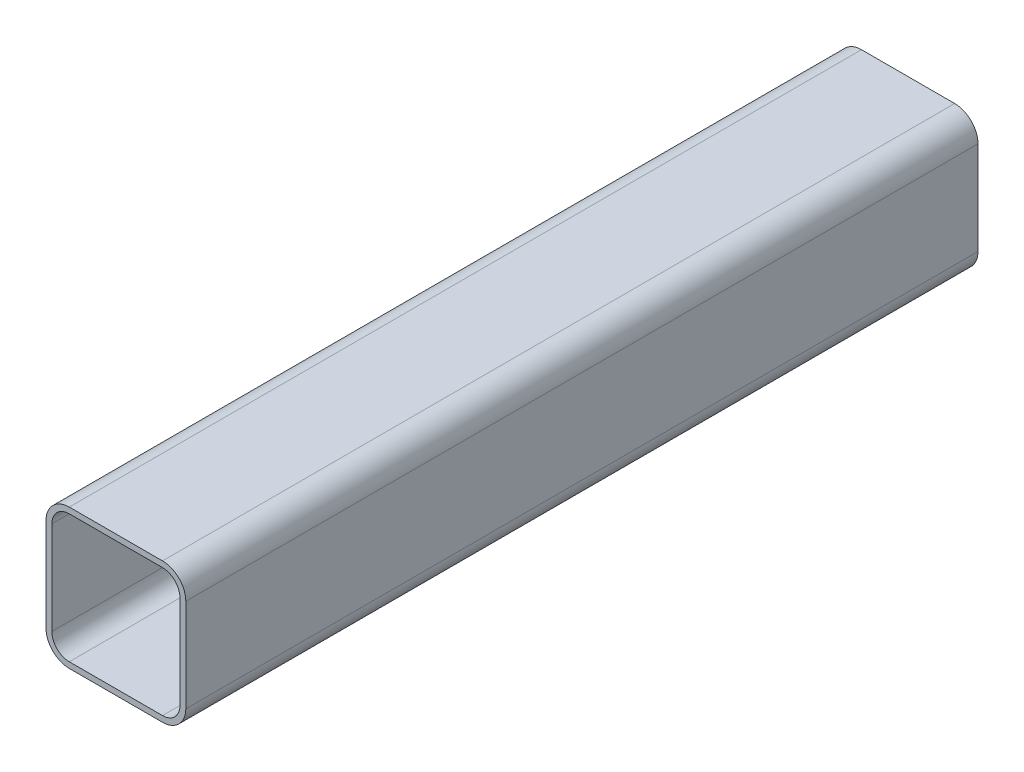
ISO-10303-21;
HEADER;
FILE_DESCRIPTION(('STEP AP214'),'2;1');
FILE_NAME('part.step','',(''),(''),'','','');
FILE_SCHEMA(('AUTOMOTIVE_DESIGN { 1 0 10303 214 1 1 1 1 }'));
ENDSEC;
DATA;
#1=APPLICATION_CONTEXT('core data for automotive mechanical design processes');
#2=APPLICATION_PROTOCOL_DEFINITION('international standard','automotive_design',2000,#1);
#3=PRODUCT_CONTEXT('',#1,'mechanical');
#4=PRODUCT('Part','Part','',(#3));
#5=PRODUCT_RELATED_PRODUCT_CATEGORY('part','',(#4));
#6=PRODUCT_DEFINITION_FORMATION('','',#4);
#7=PRODUCT_DEFINITION_CONTEXT('part definition',#1,'design');
#8=PRODUCT_DEFINITION('design','',#6,#7);
#9=PRODUCT_DEFINITION_SHAPE('','',#8);
#10=(LENGTH_UNIT() NAMED_UNIT(*) SI_UNIT(.MILLI.,.METRE.));
#11=(NAMED_UNIT(*) PLANE_ANGLE_UNIT() SI_UNIT($,.RADIAN.));
#12=(NAMED_UNIT(*) SI_UNIT($,.STERADIAN.) SOLID_ANGLE_UNIT());
#13=UNCERTAINTY_MEASURE_WITH_UNIT(LENGTH_MEASURE(1.E-05),#10,'distance_accuracy_value','');
#14=(GEOMETRIC_REPRESENTATION_CONTEXT(3) GLOBAL_UNCERTAINTY_ASSIGNED_CONTEXT((#13)) GLOBAL_UNIT_ASSIGNED_CONTEXT((#10,
#11,#12)) REPRESENTATION_CONTEXT('',''));
#15=CARTESIAN_POINT('',(0.,0.,0.));
#16=DIRECTION('',(0.,0.,1.));
#17=DIRECTION('',(1.,0.,0.));
#18=AXIS2_PLACEMENT_3D('',#15,#16,#17);
#19=CARTESIAN_POINT('',(25.4,25.4,431.8));
#20=DIRECTION('',(0.,0.,1.));
#21=DIRECTION('',(1.,0.,0.));
#22=AXIS2_PLACEMENT_3D('',#19,#20,#21);
#23=PLANE('',#22);
#24=CARTESIAN_POINT('',(25.4,25.4,431.8));
#25=DIRECTION('',(0.,0.,1.));
#26=DIRECTION('',(1.,0.,0.));
#27=AXIS2_PLACEMENT_3D('',#24,#25,#26);
#28=CIRCLE('',#27,12.7);
#29=CARTESIAN_POINT('',(38.1,25.4,431.8));
#30=VERTEX_POINT('',#29);
#31=CARTESIAN_POINT('',(25.4,38.1,431.8));
#32=VERTEX_POINT('',#31);
#33=EDGE_CURVE('E212',#30,#32,#28,.T.);
#34=ORIENTED_EDGE('',*,*,#33,.T.);
#35=DIRECTION('',(1.,0.,0.));
#36=VECTOR('',#35,1.);
#37=CARTESIAN_POINT('',(-25.4,38.1,431.8));
#38=LINE('',#37,#36);
#39=CARTESIAN_POINT('',(-25.4,38.1,431.8));
#40=VERTEX_POINT('',#39);
#41=EDGE_CURVE('E214',#40,#32,#38,.T.);
#42=ORIENTED_EDGE('',*,*,#41,.F.);
#43=CARTESIAN_POINT('',(-25.4,25.4,431.8));
#44=DIRECTION('',(0.,0.,-1.));
#45=DIRECTION('',(-1.,0.,0.));
#46=AXIS2_PLACEMENT_3D('',#43,#44,#45);
#47=CIRCLE('',#46,12.7);
#48=CARTESIAN_POINT('',(-38.1,25.4,431.8));
#49=VERTEX_POINT('',#48);
#50=EDGE_CURVE('E218',#49,#40,#47,.T.);
#51=ORIENTED_EDGE('',*,*,#50,.F.);
#52=DIRECTION('',(0.,-1.,0.));
#53=VECTOR('',#52,1.);
#54=CARTESIAN_POINT('',(-38.1,25.4,431.8));
#55=LINE('',#54,#53);
#56=CARTESIAN_POINT('',(-38.1,-25.4,431.8));
#57=VERTEX_POINT('',#56);
#58=EDGE_CURVE('E221',#49,#57,#55,.T.);
#59=ORIENTED_EDGE('',*,*,#58,.T.);
#60=CARTESIAN_POINT('',(-25.4,-25.4,431.8));
#61=DIRECTION('',(0.,0.,-1.));
#62=DIRECTION('',(-1.,0.,0.));
#63=AXIS2_PLACEMENT_3D('',#60,#61,#62);
#64=CIRCLE('',#63,12.7);
#65=CARTESIAN_POINT('',(-25.4,-38.1,431.8));
#66=VERTEX_POINT('',#65);
#67=EDGE_CURVE('E223',#66,#57,#64,.T.);
#68=ORIENTED_EDGE('',*,*,#67,.F.);
#69=DIRECTION('',(-1.,0.,0.));
#70=VECTOR('',#69,1.);
#71=CARTESIAN_POINT('',(25.4,-38.1,431.8));
#72=LINE('',#71,#70);
#73=CARTESIAN_POINT('',(25.4,-38.1,431.8));
#74=VERTEX_POINT('',#73);
#75=EDGE_CURVE('E226',#74,#66,#72,.T.);
#76=ORIENTED_EDGE('',*,*,#75,.F.);
#77=CARTESIAN_POINT('',(25.4,-25.4,431.8));
#78=DIRECTION('',(0.,0.,-1.));
#79=DIRECTION('',(-1.,0.,0.));
#80=AXIS2_PLACEMENT_3D('',#77,#78,#79);
#81=CIRCLE('',#80,12.7);
#82=CARTESIAN_POINT('',(38.1,-25.4000000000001,431.8));
#83=VERTEX_POINT('',#82);
#84=EDGE_CURVE('E229',#83,#74,#81,.T.);
#85=ORIENTED_EDGE('',*,*,#84,.F.);
#86=DIRECTION('',(0.,1.,0.));
#87=VECTOR('',#86,1.);
#88=CARTESIAN_POINT('',(38.1,-25.4000000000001,431.8));
#89=LINE('',#88,#87);
#90=EDGE_CURVE('E232',#83,#30,#89,.T.);
#91=ORIENTED_EDGE('',*,*,#90,.T.);
#92=EDGE_LOOP('',(#34,#42,#51,#59,#68,#76,#85,#91));
#93=FACE_BOUND('',#92,.T.);
#94=DIRECTION('',(1.,0.,0.));
#95=VECTOR('',#94,1.);
#96=CARTESIAN_POINT('',(-25.4,34.925,431.8));
#97=LINE('',#96,#95);
#98=CARTESIAN_POINT('',(-25.4,34.925,431.8));
#99=VERTEX_POINT('',#98);
#100=CARTESIAN_POINT('',(25.4,34.925,431.8));
#101=VERTEX_POINT('',#100);
#102=EDGE_CURVE('E152',#99,#101,#97,.T.);
#103=ORIENTED_EDGE('',*,*,#102,.T.);
#104=CARTESIAN_POINT('',(25.4,25.4,431.8));
#105=DIRECTION('',(0.,0.,1.));
#106=DIRECTION('',(1.,0.,0.));
#107=AXIS2_PLACEMENT_3D('',#104,#105,#106);
#108=CIRCLE('',#107,9.525);
#109=CARTESIAN_POINT('',(34.925,25.4,431.8));
#110=VERTEX_POINT('',#109);
#111=EDGE_CURVE('E143',#110,#101,#108,.T.);
#112=ORIENTED_EDGE('',*,*,#111,.F.);
#113=DIRECTION('',(0.,1.,0.));
#114=VECTOR('',#113,1.);
#115=CARTESIAN_POINT('',(34.925,-25.4000000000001,431.8));
#116=LINE('',#115,#114);
#117=CARTESIAN_POINT('',(34.925,-25.4000000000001,431.8));
#118=VERTEX_POINT('',#117);
#119=EDGE_CURVE('E179',#118,#110,#116,.T.);
#120=ORIENTED_EDGE('',*,*,#119,.F.);
#121=CARTESIAN_POINT('',(25.4,-25.4,431.8));
#122=DIRECTION('',(0.,0.,1.));
#123=DIRECTION('',(1.,0.,0.));
#124=AXIS2_PLACEMENT_3D('',#121,#122,#123);
#125=CIRCLE('',#124,9.525);
#126=CARTESIAN_POINT('',(25.4,-34.925,431.8));
#127=VERTEX_POINT('',#126);
#128=EDGE_CURVE('E47',#118,#127,#125,.F.);
#129=ORIENTED_EDGE('',*,*,#128,.T.);
#130=DIRECTION('',(-1.,0.,0.));
#131=VECTOR('',#130,1.);
#132=CARTESIAN_POINT('',(25.4,-34.925,431.8));
#133=LINE('',#132,#131);
#134=CARTESIAN_POINT('',(-25.4,-34.925,431.8));
#135=VERTEX_POINT('',#134);
#136=EDGE_CURVE('E175',#127,#135,#133,.T.);
#137=ORIENTED_EDGE('',*,*,#136,.T.);
#138=CARTESIAN_POINT('',(-25.4,-25.4,431.8));
#139=DIRECTION('',(0.,0.,1.));
#140=DIRECTION('',(1.,0.,0.));
#141=AXIS2_PLACEMENT_3D('',#138,#139,#140);
#142=CIRCLE('',#141,9.52499999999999);
#143=CARTESIAN_POINT('',(-34.925,-25.4,431.8));
#144=VERTEX_POINT('',#143);
#145=EDGE_CURVE('E172',#135,#144,#142,.F.);
#146=ORIENTED_EDGE('',*,*,#145,.T.);
#147=DIRECTION('',(0.,-1.,0.));
#148=VECTOR('',#147,1.);
#149=CARTESIAN_POINT('',(-34.925,25.4,431.8));
#150=LINE('',#149,#148);
#151=CARTESIAN_POINT('',(-34.925,25.4,431.8));
#152=VERTEX_POINT('',#151);
#153=EDGE_CURVE('E168',#152,#144,#150,.T.);
#154=ORIENTED_EDGE('',*,*,#153,.F.);
#155=CARTESIAN_POINT('',(-25.4,25.4,431.8));
#156=DIRECTION('',(0.,0.,1.));
#157=DIRECTION('',(1.,0.,0.));
#158=AXIS2_PLACEMENT_3D('',#155,#156,#157);
#159=CIRCLE('',#158,9.525);
#160=EDGE_CURVE('E166',#152,#99,#159,.F.);
#161=ORIENTED_EDGE('',*,*,#160,.T.);
#162=EDGE_LOOP('',(#103,#112,#120,#129,#137,#146,#154,#161));
#163=FACE_BOUND('',#162,.T.);
#164=ADVANCED_FACE('F32',(#93,#163),#23,.T.);
#165=CARTESIAN_POINT('',(25.4,25.4,0.));
#166=DIRECTION('',(0.,0.,1.));
#167=DIRECTION('',(1.,0.,0.));
#168=AXIS2_PLACEMENT_3D('',#165,#166,#167);
#169=PLANE('',#168);
#170=CARTESIAN_POINT('',(25.4,25.4,0.));
#171=DIRECTION('',(0.,0.,1.));
#172=DIRECTION('',(1.,0.,0.));
#173=AXIS2_PLACEMENT_3D('',#170,#171,#172);
#174=CIRCLE('',#173,12.7);
#175=CARTESIAN_POINT('',(38.1,25.4,0.));
#176=VERTEX_POINT('',#175);
#177=CARTESIAN_POINT('',(25.4,38.1,0.));
#178=VERTEX_POINT('',#177);
#179=EDGE_CURVE('E161',#176,#178,#174,.T.);
#180=ORIENTED_EDGE('',*,*,#179,.F.);
#181=DIRECTION('',(0.,1.,0.));
#182=VECTOR('',#181,1.);
#183=CARTESIAN_POINT('',(38.1,-25.4000000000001,0.));
#184=LINE('',#183,#182);
#185=CARTESIAN_POINT('',(38.1,-25.4000000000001,0.));
#186=VERTEX_POINT('',#185);
#187=EDGE_CURVE('E215',#186,#176,#184,.T.);
#188=ORIENTED_EDGE('',*,*,#187,.F.);
#189=CARTESIAN_POINT('',(25.4,-25.4,0.));
#190=DIRECTION('',(0.,0.,-1.));
#191=DIRECTION('',(-1.,0.,0.));
#192=AXIS2_PLACEMENT_3D('',#189,#190,#191);
#193=CIRCLE('',#192,12.7);
#194=CARTESIAN_POINT('',(25.4,-38.1,0.));
#195=VERTEX_POINT('',#194);
#196=EDGE_CURVE('E252',#186,#195,#193,.T.);
#197=ORIENTED_EDGE('',*,*,#196,.T.);
#198=DIRECTION('',(-1.,0.,0.));
#199=VECTOR('',#198,1.);
#200=CARTESIAN_POINT('',(25.4,-38.1,0.));
#201=LINE('',#200,#199);
#202=CARTESIAN_POINT('',(-25.4,-38.1,0.));
#203=VERTEX_POINT('',#202);
#204=EDGE_CURVE('E249',#195,#203,#201,.T.);
#205=ORIENTED_EDGE('',*,*,#204,.T.);
#206=CARTESIAN_POINT('',(-25.4,-25.4,0.));
#207=DIRECTION('',(0.,0.,-1.));
#208=DIRECTION('',(-1.,0.,0.));
#209=AXIS2_PLACEMENT_3D('',#206,#207,#208);
#210=CIRCLE('',#209,12.7);
#211=CARTESIAN_POINT('',(-38.1,-25.4,0.));
#212=VERTEX_POINT('',#211);
#213=EDGE_CURVE('E246',#203,#212,#210,.T.);
#214=ORIENTED_EDGE('',*,*,#213,.T.);
#215=DIRECTION('',(0.,-1.,0.));
#216=VECTOR('',#215,1.);
#217=CARTESIAN_POINT('',(-38.1,25.4,0.));
#218=LINE('',#217,#216);
#219=CARTESIAN_POINT('',(-38.1,25.4,0.));
#220=VERTEX_POINT('',#219);
#221=EDGE_CURVE('E243',#220,#212,#218,.T.);
#222=ORIENTED_EDGE('',*,*,#221,.F.);
#223=CARTESIAN_POINT('',(-25.4,25.4,0.));
#224=DIRECTION('',(0.,0.,-1.));
#225=DIRECTION('',(-1.,0.,0.));
#226=AXIS2_PLACEMENT_3D('',#223,#224,#225);
#227=CIRCLE('',#226,12.7);
#228=CARTESIAN_POINT('',(-25.4,38.1,0.));
#229=VERTEX_POINT('',#228);
#230=EDGE_CURVE('E240',#220,#229,#227,.T.);
#231=ORIENTED_EDGE('',*,*,#230,.T.);
#232=DIRECTION('',(1.,0.,0.));
#233=VECTOR('',#232,1.);
#234=CARTESIAN_POINT('',(-25.4,38.1,0.));
#235=LINE('',#234,#233);
#236=EDGE_CURVE('E237',#229,#178,#235,.T.);
#237=ORIENTED_EDGE('',*,*,#236,.T.);
#238=EDGE_LOOP('',(#180,#188,#197,#205,#214,#222,#231,#237));
#239=FACE_BOUND('',#238,.T.);
#240=CARTESIAN_POINT('',(25.4,25.4,0.));
#241=DIRECTION('',(0.,0.,1.));
#242=DIRECTION('',(1.,0.,0.));
#243=AXIS2_PLACEMENT_3D('',#240,#241,#242);
#244=CIRCLE('',#243,9.525);
#245=CARTESIAN_POINT('',(34.925,25.4,0.));
#246=VERTEX_POINT('',#245);
#247=CARTESIAN_POINT('',(25.4,34.925,0.));
#248=VERTEX_POINT('',#247);
#249=EDGE_CURVE('E55',#246,#248,#244,.T.);
#250=ORIENTED_EDGE('',*,*,#249,.T.);
#251=DIRECTION('',(1.,0.,0.));
#252=VECTOR('',#251,1.);
#253=CARTESIAN_POINT('',(-25.4,34.925,0.));
#254=LINE('',#253,#252);
#255=CARTESIAN_POINT('',(-25.4,34.925,0.));
#256=VERTEX_POINT('',#255);
#257=EDGE_CURVE('E160',#256,#248,#254,.T.);
#258=ORIENTED_EDGE('',*,*,#257,.F.);
#259=CARTESIAN_POINT('',(-25.4,25.4,0.));
#260=DIRECTION('',(0.,0.,1.));
#261=DIRECTION('',(1.,0.,0.));
#262=AXIS2_PLACEMENT_3D('',#259,#260,#261);
#263=CIRCLE('',#262,9.525);
#264=CARTESIAN_POINT('',(-34.925,25.4,0.));
#265=VERTEX_POINT('',#264);
#266=EDGE_CURVE('E183',#265,#256,#263,.F.);
#267=ORIENTED_EDGE('',*,*,#266,.F.);
#268=DIRECTION('',(0.,-1.,0.));
#269=VECTOR('',#268,1.);
#270=CARTESIAN_POINT('',(-34.925,25.4,0.));
#271=LINE('',#270,#269);
#272=CARTESIAN_POINT('',(-34.925,-25.4,0.));
#273=VERTEX_POINT('',#272);
#274=EDGE_CURVE('E186',#265,#273,#271,.T.);
#275=ORIENTED_EDGE('',*,*,#274,.T.);
#276=CARTESIAN_POINT('',(-25.4,-25.4,0.));
#277=DIRECTION('',(0.,0.,1.));
#278=DIRECTION('',(1.,0.,0.));
#279=AXIS2_PLACEMENT_3D('',#276,#277,#278);
#280=CIRCLE('',#279,9.52499999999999);
#281=CARTESIAN_POINT('',(-25.4,-34.925,0.));
#282=VERTEX_POINT('',#281);
#283=EDGE_CURVE('E189',#282,#273,#280,.F.);
#284=ORIENTED_EDGE('',*,*,#283,.F.);
#285=DIRECTION('',(-1.,0.,0.));
#286=VECTOR('',#285,1.);
#287=CARTESIAN_POINT('',(25.4,-34.925,0.));
#288=LINE('',#287,#286);
#289=CARTESIAN_POINT('',(25.4,-34.925,0.));
#290=VERTEX_POINT('',#289);
#291=EDGE_CURVE('E192',#290,#282,#288,.T.);
#292=ORIENTED_EDGE('',*,*,#291,.F.);
#293=CARTESIAN_POINT('',(25.4,-25.4,0.));
#294=DIRECTION('',(0.,0.,1.));
#295=DIRECTION('',(1.,0.,0.));
#296=AXIS2_PLACEMENT_3D('',#293,#294,#295);
#297=CIRCLE('',#296,9.525);
#298=CARTESIAN_POINT('',(34.925,-25.4000000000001,0.));
#299=VERTEX_POINT('',#298);
#300=EDGE_CURVE('E195',#299,#290,#297,.F.);
#301=ORIENTED_EDGE('',*,*,#300,.F.);
#302=DIRECTION('',(0.,1.,0.));
#303=VECTOR('',#302,1.);
#304=CARTESIAN_POINT('',(34.925,-25.4000000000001,0.));
#305=LINE('',#304,#303);
#306=EDGE_CURVE('E153',#299,#246,#305,.T.);
#307=ORIENTED_EDGE('',*,*,#306,.T.);
#308=EDGE_LOOP('',(#250,#258,#267,#275,#284,#292,#301,#307));
#309=FACE_BOUND('',#308,.T.);
#310=ADVANCED_FACE('F279',(#239,#309),#169,.F.);
#311=CARTESIAN_POINT('',(25.4,25.4,431.8));
#312=DIRECTION('',(0.,0.,-1.));
#313=DIRECTION('',(-1.,0.,0.));
#314=AXIS2_PLACEMENT_3D('',#311,#312,#313);
#315=CYLINDRICAL_SURFACE('',#314,12.7);
#316=ORIENTED_EDGE('',*,*,#179,.T.);
#317=DIRECTION('',(0.,0.,-1.));
#318=VECTOR('',#317,1.);
#319=CARTESIAN_POINT('',(25.4,38.1,431.8));
#320=LINE('',#319,#318);
#321=EDGE_CURVE('E11',#32,#178,#320,.T.);
#322=ORIENTED_EDGE('',*,*,#321,.F.);
#323=ORIENTED_EDGE('',*,*,#33,.F.);
#324=DIRECTION('',(0.,0.,-1.));
#325=VECTOR('',#324,1.);
#326=CARTESIAN_POINT('',(38.1,25.4,431.8));
#327=LINE('',#326,#325);
#328=EDGE_CURVE('E234',#30,#176,#327,.T.);
#329=ORIENTED_EDGE('',*,*,#328,.T.);
#330=EDGE_LOOP('',(#316,#322,#323,#329));
#331=FACE_BOUND('',#330,.T.);
#332=ADVANCED_FACE('F34',(#331),#315,.T.);
#333=CARTESIAN_POINT('',(-25.4,38.1,431.8));
#334=DIRECTION('',(0.,1.,0.));
#335=DIRECTION('',(-1.,0.,0.));
#336=AXIS2_PLACEMENT_3D('',#333,#334,#335);
#337=PLANE('',#336);
#338=ORIENTED_EDGE('',*,*,#236,.F.);
#339=DIRECTION('',(0.,0.,-1.));
#340=VECTOR('',#339,1.);
#341=CARTESIAN_POINT('',(-25.4,38.1,431.8));
#342=LINE('',#341,#340);
#343=EDGE_CURVE('E40',#40,#229,#342,.T.);
#344=ORIENTED_EDGE('',*,*,#343,.F.);
#345=ORIENTED_EDGE('',*,*,#41,.T.);
#346=ORIENTED_EDGE('',*,*,#321,.T.);
#347=EDGE_LOOP('',(#338,#344,#345,#346));
#348=FACE_BOUND('',#347,.T.);
#349=ADVANCED_FACE('F274',(#348),#337,.T.);
#350=CARTESIAN_POINT('',(-25.4,25.4,431.8));
#351=DIRECTION('',(0.,0.,-1.));
#352=DIRECTION('',(-1.,0.,0.));
#353=AXIS2_PLACEMENT_3D('',#350,#351,#352);
#354=CYLINDRICAL_SURFACE('',#353,12.7);
#355=ORIENTED_EDGE('',*,*,#230,.F.);
#356=DIRECTION('',(0.,0.,-1.));
#357=VECTOR('',#356,1.);
#358=CARTESIAN_POINT('',(-38.1,25.4,431.8));
#359=LINE('',#358,#357);
#360=EDGE_CURVE('E266',#49,#220,#359,.T.);
#361=ORIENTED_EDGE('',*,*,#360,.F.);
#362=ORIENTED_EDGE('',*,*,#50,.T.);
#363=ORIENTED_EDGE('',*,*,#343,.T.);
#364=EDGE_LOOP('',(#355,#361,#362,#363));
#365=FACE_BOUND('',#364,.T.);
#366=ADVANCED_FACE('F270',(#365),#354,.T.);
#367=CARTESIAN_POINT('',(-38.1,25.4,431.8));
#368=DIRECTION('',(1.,0.,0.));
#369=DIRECTION('',(0.,1.,0.));
#370=AXIS2_PLACEMENT_3D('',#367,#368,#369);
#371=PLANE('',#370);
#372=ORIENTED_EDGE('',*,*,#221,.T.);
#373=DIRECTION('',(0.,0.,-1.));
#374=VECTOR('',#373,1.);
#375=CARTESIAN_POINT('',(-38.1,-25.4,431.8));
#376=LINE('',#375,#374);
#377=EDGE_CURVE('E264',#57,#212,#376,.T.);
#378=ORIENTED_EDGE('',*,*,#377,.F.);
#379=ORIENTED_EDGE('',*,*,#58,.F.);
#380=ORIENTED_EDGE('',*,*,#360,.T.);
#381=EDGE_LOOP('',(#372,#378,#379,#380));
#382=FACE_BOUND('',#381,.T.);
#383=ADVANCED_FACE('F284',(#382),#371,.F.);
#384=CARTESIAN_POINT('',(-25.4,-25.4,431.8));
#385=DIRECTION('',(0.,0.,-1.));
#386=DIRECTION('',(-1.,0.,0.));
#387=AXIS2_PLACEMENT_3D('',#384,#385,#386);
#388=CYLINDRICAL_SURFACE('',#387,12.7);
#389=ORIENTED_EDGE('',*,*,#213,.F.);
#390=DIRECTION('',(0.,0.,-1.));
#391=VECTOR('',#390,1.);
#392=CARTESIAN_POINT('',(-25.4,-38.1,431.8));
#393=LINE('',#392,#391);
#394=EDGE_CURVE('E262',#66,#203,#393,.T.);
#395=ORIENTED_EDGE('',*,*,#394,.F.);
#396=ORIENTED_EDGE('',*,*,#67,.T.);
#397=ORIENTED_EDGE('',*,*,#377,.T.);
#398=EDGE_LOOP('',(#389,#395,#396,#397));
#399=FACE_BOUND('',#398,.T.);
#400=ADVANCED_FACE('F303',(#399),#388,.T.);
#401=CARTESIAN_POINT('',(25.4,-38.1,431.8));
#402=DIRECTION('',(0.,-1.,0.));
#403=DIRECTION('',(1.,0.,0.));
#404=AXIS2_PLACEMENT_3D('',#401,#402,#403);
#405=PLANE('',#404);
#406=ORIENTED_EDGE('',*,*,#204,.F.);
#407=DIRECTION('',(0.,0.,-1.));
#408=VECTOR('',#407,1.);
#409=CARTESIAN_POINT('',(25.4,-38.1,431.8));
#410=LINE('',#409,#408);
#411=EDGE_CURVE('E260',#74,#195,#410,.T.);
#412=ORIENTED_EDGE('',*,*,#411,.F.);
#413=ORIENTED_EDGE('',*,*,#75,.T.);
#414=ORIENTED_EDGE('',*,*,#394,.T.);
#415=EDGE_LOOP('',(#406,#412,#413,#414));
#416=FACE_BOUND('',#415,.T.);
#417=ADVANCED_FACE('F301',(#416),#405,.T.);
#418=CARTESIAN_POINT('',(25.4,-25.4,431.8));
#419=DIRECTION('',(0.,0.,-1.));
#420=DIRECTION('',(-1.,0.,0.));
#421=AXIS2_PLACEMENT_3D('',#418,#419,#420);
#422=CYLINDRICAL_SURFACE('',#421,12.7);
#423=ORIENTED_EDGE('',*,*,#196,.F.);
#424=DIRECTION('',(0.,0.,-1.));
#425=VECTOR('',#424,1.);
#426=CARTESIAN_POINT('',(38.1,-25.4000000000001,431.8));
#427=LINE('',#426,#425);
#428=EDGE_CURVE('E258',#83,#186,#427,.T.);
#429=ORIENTED_EDGE('',*,*,#428,.F.);
#430=ORIENTED_EDGE('',*,*,#84,.T.);
#431=ORIENTED_EDGE('',*,*,#411,.T.);
#432=EDGE_LOOP('',(#423,#429,#430,#431));
#433=FACE_BOUND('',#432,.T.);
#434=ADVANCED_FACE('F297',(#433),#422,.T.);
#435=CARTESIAN_POINT('',(38.1,-25.4000000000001,431.8));
#436=DIRECTION('',(-1.,0.,0.));
#437=DIRECTION('',(0.,-1.,0.));
#438=AXIS2_PLACEMENT_3D('',#435,#436,#437);
#439=PLANE('',#438);
#440=ORIENTED_EDGE('',*,*,#187,.T.);
#441=ORIENTED_EDGE('',*,*,#328,.F.);
#442=ORIENTED_EDGE('',*,*,#90,.F.);
#443=ORIENTED_EDGE('',*,*,#428,.T.);
#444=EDGE_LOOP('',(#440,#441,#442,#443));
#445=FACE_BOUND('',#444,.T.);
#446=ADVANCED_FACE('F321',(#445),#439,.F.);
#447=CARTESIAN_POINT('',(25.4,25.4,431.8));
#448=DIRECTION('',(0.,0.,-1.));
#449=DIRECTION('',(-1.,0.,0.));
#450=AXIS2_PLACEMENT_3D('',#447,#448,#449);
#451=CYLINDRICAL_SURFACE('',#450,9.525);
#452=ORIENTED_EDGE('',*,*,#249,.F.);
#453=DIRECTION('',(0.,0.,-1.));
#454=VECTOR('',#453,1.);
#455=CARTESIAN_POINT('',(34.925,25.4,431.8));
#456=LINE('',#455,#454);
#457=EDGE_CURVE('E148',#110,#246,#456,.T.);
#458=ORIENTED_EDGE('',*,*,#457,.F.);
#459=ORIENTED_EDGE('',*,*,#111,.T.);
#460=DIRECTION('',(0.,0.,-1.));
#461=VECTOR('',#460,1.);
#462=CARTESIAN_POINT('',(25.4,34.925,431.8));
#463=LINE('',#462,#461);
#464=EDGE_CURVE('E146',#101,#248,#463,.T.);
#465=ORIENTED_EDGE('',*,*,#464,.T.);
#466=EDGE_LOOP('',(#452,#458,#459,#465));
#467=FACE_BOUND('',#466,.T.);
#468=ADVANCED_FACE('F145',(#467),#451,.F.);
#469=CARTESIAN_POINT('',(-25.4,34.925,431.8));
#470=DIRECTION('',(0.,1.,0.));
#471=DIRECTION('',(-1.,0.,0.));
#472=AXIS2_PLACEMENT_3D('',#469,#470,#471);
#473=PLANE('',#472);
#474=ORIENTED_EDGE('',*,*,#257,.T.);
#475=ORIENTED_EDGE('',*,*,#464,.F.);
#476=ORIENTED_EDGE('',*,*,#102,.F.);
#477=DIRECTION('',(0.,0.,-1.));
#478=VECTOR('',#477,1.);
#479=CARTESIAN_POINT('',(-25.4,34.925,431.8));
#480=LINE('',#479,#478);
#481=EDGE_CURVE('E162',#99,#256,#480,.T.);
#482=ORIENTED_EDGE('',*,*,#481,.T.);
#483=EDGE_LOOP('',(#474,#475,#476,#482));
#484=FACE_BOUND('',#483,.T.);
#485=ADVANCED_FACE('F157',(#484),#473,.F.);
#486=CARTESIAN_POINT('',(-25.4,25.4,431.8));
#487=DIRECTION('',(0.,0.,-1.));
#488=DIRECTION('',(-1.,0.,0.));
#489=AXIS2_PLACEMENT_3D('',#486,#487,#488);
#490=CYLINDRICAL_SURFACE('',#489,9.525);
#491=ORIENTED_EDGE('',*,*,#266,.T.);
#492=ORIENTED_EDGE('',*,*,#481,.F.);
#493=ORIENTED_EDGE('',*,*,#160,.F.);
#494=DIRECTION('',(0.,0.,-1.));
#495=VECTOR('',#494,1.);
#496=CARTESIAN_POINT('',(-34.925,25.4,431.8));
#497=LINE('',#496,#495);
#498=EDGE_CURVE('E209',#152,#265,#497,.T.);
#499=ORIENTED_EDGE('',*,*,#498,.T.);
#500=EDGE_LOOP('',(#491,#492,#493,#499));
#501=FACE_BOUND('',#500,.T.);
#502=ADVANCED_FACE('F344',(#501),#490,.F.);
#503=CARTESIAN_POINT('',(-34.925,25.4,431.8));
#504=DIRECTION('',(1.,0.,0.));
#505=DIRECTION('',(0.,1.,0.));
#506=AXIS2_PLACEMENT_3D('',#503,#504,#505);
#507=PLANE('',#506);
#508=ORIENTED_EDGE('',*,*,#274,.F.);
#509=ORIENTED_EDGE('',*,*,#498,.F.);
#510=ORIENTED_EDGE('',*,*,#153,.T.);
#511=DIRECTION('',(0.,0.,-1.));
#512=VECTOR('',#511,1.);
#513=CARTESIAN_POINT('',(-34.925,-25.4,431.8));
#514=LINE('',#513,#512);
#515=EDGE_CURVE('E207',#144,#273,#514,.T.);
#516=ORIENTED_EDGE('',*,*,#515,.T.);
#517=EDGE_LOOP('',(#508,#509,#510,#516));
#518=FACE_BOUND('',#517,.T.);
#519=ADVANCED_FACE('F350',(#518),#507,.T.);
#520=CARTESIAN_POINT('',(-25.4,-25.4,431.8));
#521=DIRECTION('',(0.,0.,-1.));
#522=DIRECTION('',(-1.,0.,0.));
#523=AXIS2_PLACEMENT_3D('',#520,#521,#522);
#524=CYLINDRICAL_SURFACE('',#523,9.52499999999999);
#525=ORIENTED_EDGE('',*,*,#283,.T.);
#526=ORIENTED_EDGE('',*,*,#515,.F.);
#527=ORIENTED_EDGE('',*,*,#145,.F.);
#528=DIRECTION('',(0.,0.,-1.));
#529=VECTOR('',#528,1.);
#530=CARTESIAN_POINT('',(-25.4,-34.925,431.8));
#531=LINE('',#530,#529);
#532=EDGE_CURVE('E205',#135,#282,#531,.T.);
#533=ORIENTED_EDGE('',*,*,#532,.T.);
#534=EDGE_LOOP('',(#525,#526,#527,#533));
#535=FACE_BOUND('',#534,.T.);
#536=ADVANCED_FACE('F358',(#535),#524,.F.);
#537=CARTESIAN_POINT('',(25.4,-34.925,431.8));
#538=DIRECTION('',(0.,-1.,0.));
#539=DIRECTION('',(1.,0.,0.));
#540=AXIS2_PLACEMENT_3D('',#537,#538,#539);
#541=PLANE('',#540);
#542=ORIENTED_EDGE('',*,*,#291,.T.);
#543=ORIENTED_EDGE('',*,*,#532,.F.);
#544=ORIENTED_EDGE('',*,*,#136,.F.);
#545=DIRECTION('',(0.,0.,-1.));
#546=VECTOR('',#545,1.);
#547=CARTESIAN_POINT('',(25.4,-34.925,431.8));
#548=LINE('',#547,#546);
#549=EDGE_CURVE('E203',#127,#290,#548,.T.);
#550=ORIENTED_EDGE('',*,*,#549,.T.);
#551=EDGE_LOOP('',(#542,#543,#544,#550));
#552=FACE_BOUND('',#551,.T.);
#553=ADVANCED_FACE('F366',(#552),#541,.F.);
#554=CARTESIAN_POINT('',(25.4,-25.4,431.8));
#555=DIRECTION('',(0.,0.,-1.));
#556=DIRECTION('',(-1.,0.,0.));
#557=AXIS2_PLACEMENT_3D('',#554,#555,#556);
#558=CYLINDRICAL_SURFACE('',#557,9.525);
#559=ORIENTED_EDGE('',*,*,#300,.T.);
#560=ORIENTED_EDGE('',*,*,#549,.F.);
#561=ORIENTED_EDGE('',*,*,#128,.F.);
#562=DIRECTION('',(0.,0.,-1.));
#563=VECTOR('',#562,1.);
#564=CARTESIAN_POINT('',(34.925,-25.4000000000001,431.8));
#565=LINE('',#564,#563);
#566=EDGE_CURVE('E201',#118,#299,#565,.T.);
#567=ORIENTED_EDGE('',*,*,#566,.T.);
#568=EDGE_LOOP('',(#559,#560,#561,#567));
#569=FACE_BOUND('',#568,.T.);
#570=ADVANCED_FACE('F374',(#569),#558,.F.);
#571=CARTESIAN_POINT('',(34.925,-25.4000000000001,431.8));
#572=DIRECTION('',(-1.,0.,0.));
#573=DIRECTION('',(0.,-1.,0.));
#574=AXIS2_PLACEMENT_3D('',#571,#572,#573);
#575=PLANE('',#574);
#576=ORIENTED_EDGE('',*,*,#306,.F.);
#577=ORIENTED_EDGE('',*,*,#566,.F.);
#578=ORIENTED_EDGE('',*,*,#119,.T.);
#579=ORIENTED_EDGE('',*,*,#457,.T.);
#580=EDGE_LOOP('',(#576,#577,#578,#579));
#581=FACE_BOUND('',#580,.T.);
#582=ADVANCED_FACE('F382',(#581),#575,.T.);
#583=CLOSED_SHELL('',(#164,#310,#332,#349,#366,#383,#400,#417,#434,#446,#468,#485,#502,#519,
#536,#553,#570,#582));
#584=MANIFOLD_SOLID_BREP('B2',#583);
#585=ADVANCED_BREP_SHAPE_REPRESENTATION('',(#18,#584),#14);
#586=SHAPE_DEFINITION_REPRESENTATION(#9,#585);
ENDSEC;
END-ISO-10303-21;
